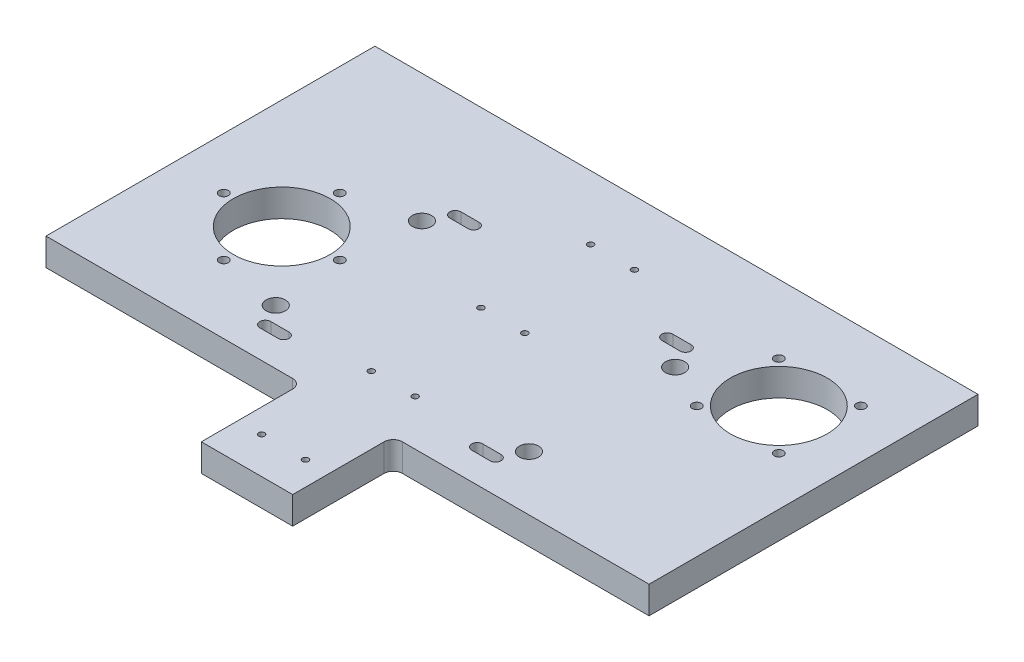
from build123d import *

# Parameters (mm, degrees)
ESQUISSE1_W              = 330
ESQUISSE1_H              = 150
EXTRUSION1_DEPTH         = 15
ESQUISSE2_R              = 26.5
ESQUISSE2_R_2            = 2.5
EXTRUSION2_DEPTH         = 182.865334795
ESQUISSE4_W              = 50
ESQUISSE4_H              = 15
SUPPORT_MORS_FIXE_DEPTH  = 55
ESQUISSE6_W              = 330
ESQUISSE6_H              = 15
EXTRUSION6_DEPTH         = 30
EXTRUSION9_REACH         = 212.594
ESQUISSE13_R             = 5.25
EXTRUSION10_REACH        = 212.594
FIXATION_GLISSI_RE_REACH = 212.594
ESQUISSE15_R             = 1.65
CONG_2_R                 = 5


with BuildPart() as part:
    # Esquisse1 → Extrusion1 (new body)
    with BuildSketch(Plane(origin=(0, 0, 0), x_dir=(1, 0, 0), z_dir=(0, 1, 0))):
        Rectangle(ESQUISSE1_W, ESQUISSE1_H)
    extrude(amount=-EXTRUSION1_DEPTH)

    # Esquisse2 → Extrusion2 (cut, through all)
    with BuildSketch(Plane(origin=(0, 0, 0), x_dir=(-1, 0, 0), z_dir=(0, 1, 0))):
        with Locations(Location((-116, -45, 0), (0, 0, 90))):
            Circle(ESQUISSE2_R)
        with Locations(Location((105, 6, 0), (0, 0, 90))):
            Circle(ESQUISSE2_R)
        with Locations(Location((104.999999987, -25.749982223, 0), (0, 0, 90))):
            Circle(ESQUISSE2_R_2)
        with Locations(Location((-138.450640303, -22.549359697, 0), (0, 0, 90))):
            Circle(ESQUISSE2_R_2)
        with Locations(Location((-93.549359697, -22.549359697, 0), (0, 0, 90))):
            Circle(ESQUISSE2_R_2)
        with Locations(Location((-93.549359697, -67.450640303, 0), (0, 0, 90))):
            Circle(ESQUISSE2_R_2)
        with Locations(Location((-138.450640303, -67.450640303, 0), (0, 0, 90))):
            Circle(ESQUISSE2_R_2)
        with Locations(Location((73.234990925, 5.984976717, 0), (0, 0, 90))):
            Circle(ESQUISSE2_R_2)
        with Locations(Location((104.969949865, 37.749985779, 0), (0, 0, 90))):
            Circle(ESQUISSE2_R_2)
        with Locations(Location((136.734958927, 6.015026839, 0), (0, 0, 90))):
            Circle(ESQUISSE2_R_2)
    extrude(amount=-EXTRUSION2_DEPTH, mode=Mode.SUBTRACT)

    # Esquisse4 → support mors fixe (add)
    with BuildSketch(Plane.XY.offset(75)):
        with Locations((0, -7.5)):
            Rectangle(ESQUISSE4_W, ESQUISSE4_H)
    extrude(amount=SUPPORT_MORS_FIXE_DEPTH)

    # Esquisse6 → Extrusion6 (add)
    with BuildSketch(Plane(origin=(0, 0, -75), x_dir=(-1, 0, 0), z_dir=(0, 0, -1))):
        with Locations((0, -7.5)):
            Rectangle(ESQUISSE6_W, ESQUISSE6_H)
    extrude(amount=EXTRUSION6_DEPTH)

    # Esquisse13 → Extrusion9 (cut, up to next)
    with BuildSketch(Plane(origin=(0, 0, 0), x_dir=(-1, 0, 0), z_dir=(0, 1, 0)), mode=Mode.PRIVATE) as extrusion9_sk1:
        with Locations(Location((69.28, -35, 0), (0, 0, 90))):
            Circle(ESQUISSE13_R)
    extrusion9_tool1 = extrude(extrusion9_sk1.sketch, amount=-EXTRUSION9_REACH, mode=Mode.PRIVATE) & part.part
    # Esquisse13 → Extrusion9 (cut, up to next)
    with BuildSketch(Plane(origin=(0, 0, 0), x_dir=(-1, 0, 0), z_dir=(0, 1, 0)), mode=Mode.PRIVATE) as extrusion9_sk2:
        with Locations(Location((69.28, 45, 0), (0, 0, 90))):
            Circle(ESQUISSE13_R)
    extrusion9_tool2 = extrude(extrusion9_sk2.sketch, amount=-EXTRUSION9_REACH, mode=Mode.PRIVATE) & part.part
    # Esquisse13 → Extrusion9 (cut, up to next)
    with BuildSketch(Plane(origin=(0, 0, 0), x_dir=(-1, 0, 0), z_dir=(0, 1, 0)), mode=Mode.PRIVATE) as extrusion9_sk3:
        with Locations(Location((-69.28, -35, 0), (0, 0, 90))):
            Circle(ESQUISSE13_R)
    extrusion9_tool3 = extrude(extrusion9_sk3.sketch, amount=-EXTRUSION9_REACH, mode=Mode.PRIVATE) & part.part
    # Esquisse13 → Extrusion9 (cut, up to next)
    with BuildSketch(Plane(origin=(0, 0, 0), x_dir=(-1, 0, 0), z_dir=(0, 1, 0)), mode=Mode.PRIVATE) as extrusion9_sk4:
        with Locations(Location((-69.28, 45, 0), (0, 0, 90))):
            Circle(ESQUISSE13_R)
    extrusion9_tool4 = extrude(extrusion9_sk4.sketch, amount=-EXTRUSION9_REACH, mode=Mode.PRIVATE) & part.part
    add(extrusion9_tool1.solids().sort_by_distance((-69.28, 0, -35))[0], mode=Mode.SUBTRACT)
    add(extrusion9_tool2.solids().sort_by_distance((-69.28, 0, 45))[0], mode=Mode.SUBTRACT)
    add(extrusion9_tool3.solids().sort_by_distance((69.28, 0, -35))[0], mode=Mode.SUBTRACT)
    add(extrusion9_tool4.solids().sort_by_distance((69.28, 0, 45))[0], mode=Mode.SUBTRACT)

    # Esquisse14 → Extrusion10 (cut, up to next)
    with BuildSketch(Plane(origin=(0, 0, 0), x_dir=(-1, 0, 0), z_dir=(0, 1, 0)), mode=Mode.PRIVATE) as extrusion10_sk1:
        with BuildLine():
            Line((63, 54), (53, 54))
            ThreePointArc((53, 54), (50, 57), (53, 60))
            Line((53, 60), (63, 60))
            ThreePointArc((63, 60), (66, 57), (63, 54))
        make_face()
    extrusion10_tool1 = extrude(extrusion10_sk1.sketch, amount=-EXTRUSION10_REACH, mode=Mode.PRIVATE) & part.part
    # Esquisse14 → Extrusion10 (cut, up to next)
    with BuildSketch(Plane(origin=(0, 0, 0), x_dir=(-1, 0, 0), z_dir=(0, 1, 0)), mode=Mode.PRIVATE) as extrusion10_sk2:
        with BuildLine():
            Line((-53, 54), (-63, 54))
            ThreePointArc((-63, 54), (-66, 57), (-63, 60))
            Line((-63, 60), (-53, 60))
            ThreePointArc((-53, 60), (-50, 57), (-53, 54))
        make_face()
    extrusion10_tool2 = extrude(extrusion10_sk2.sketch, amount=-EXTRUSION10_REACH, mode=Mode.PRIVATE) & part.part
    # Esquisse14 → Extrusion10 (cut, up to next)
    with BuildSketch(Plane(origin=(0, 0, 0), x_dir=(-1, 0, 0), z_dir=(0, 1, 0)), mode=Mode.PRIVATE) as extrusion10_sk3:
        with BuildLine():
            Line((63, -50), (53, -50))
            ThreePointArc((53, -50), (50, -47), (53, -44))
            Line((53, -44), (63, -44))
            ThreePointArc((63, -44), (66, -47), (63, -50))
        make_face()
    extrusion10_tool3 = extrude(extrusion10_sk3.sketch, amount=-EXTRUSION10_REACH, mode=Mode.PRIVATE) & part.part
    # Esquisse14 → Extrusion10 (cut, up to next)
    with BuildSketch(Plane(origin=(0, 0, 0), x_dir=(-1, 0, 0), z_dir=(0, 1, 0)), mode=Mode.PRIVATE) as extrusion10_sk4:
        with BuildLine():
            Line((-53, -50), (-63, -50))
            ThreePointArc((-63, -50), (-66, -47), (-63, -44))
            Line((-63, -44), (-53, -44))
            ThreePointArc((-53, -44), (-50, -47), (-53, -50))
        make_face()
    extrusion10_tool4 = extrude(extrusion10_sk4.sketch, amount=-EXTRUSION10_REACH, mode=Mode.PRIVATE) & part.part
    add(extrusion10_tool1.solids().sort_by_distance((-58, 0, 57))[0], mode=Mode.SUBTRACT)
    add(extrusion10_tool2.solids().sort_by_distance((58, 0, 57))[0], mode=Mode.SUBTRACT)
    add(extrusion10_tool3.solids().sort_by_distance((-58, 0, -47))[0], mode=Mode.SUBTRACT)
    add(extrusion10_tool4.solids().sort_by_distance((58, 0, -47))[0], mode=Mode.SUBTRACT)

    # Esquisse15 → fixation glissi_re (cut, up to next)
    with BuildSketch(Plane.XZ.offset(15), mode=Mode.PRIVATE) as fixation_glissi_re_sk1:
        with Locations(Location((12, 110, 0), (0, 0, 270))):
            Circle(ESQUISSE15_R)
    fixation_glissi_re_tool1 = extrude(fixation_glissi_re_sk1.sketch, amount=-FIXATION_GLISSI_RE_REACH, mode=Mode.PRIVATE) & part.part
    # Esquisse15 → fixation glissi_re (cut, up to next)
    with BuildSketch(Plane.XZ.offset(15), mode=Mode.PRIVATE) as fixation_glissi_re_sk2:
        with Locations(Location((-12, 110, 0), (0, 0, 270))):
            Circle(ESQUISSE15_R)
    fixation_glissi_re_tool2 = extrude(fixation_glissi_re_sk2.sketch, amount=-FIXATION_GLISSI_RE_REACH, mode=Mode.PRIVATE) & part.part
    # Esquisse15 → fixation glissi_re (cut, up to next)
    with BuildSketch(Plane.XZ.offset(15), mode=Mode.PRIVATE) as fixation_glissi_re_sk3:
        with Locations(Location((-12, 50, 0), (0, 0, 270))):
            Circle(ESQUISSE15_R)
    fixation_glissi_re_tool3 = extrude(fixation_glissi_re_sk3.sketch, amount=-FIXATION_GLISSI_RE_REACH, mode=Mode.PRIVATE) & part.part
    # Esquisse15 → fixation glissi_re (cut, up to next)
    with BuildSketch(Plane.XZ.offset(15), mode=Mode.PRIVATE) as fixation_glissi_re_sk4:
        with Locations(Location((12, 50, 0), (0, 0, 270))):
            Circle(ESQUISSE15_R)
    fixation_glissi_re_tool4 = extrude(fixation_glissi_re_sk4.sketch, amount=-FIXATION_GLISSI_RE_REACH, mode=Mode.PRIVATE) & part.part
    # Esquisse15 → fixation glissi_re (cut, up to next)
    with BuildSketch(Plane.XZ.offset(15), mode=Mode.PRIVATE) as fixation_glissi_re_sk5:
        with Locations(Location((-12, -10, 0), (0, 0, 270))):
            Circle(ESQUISSE15_R)
    fixation_glissi_re_tool5 = extrude(fixation_glissi_re_sk5.sketch, amount=-FIXATION_GLISSI_RE_REACH, mode=Mode.PRIVATE) & part.part
    # Esquisse15 → fixation glissi_re (cut, up to next)
    with BuildSketch(Plane.XZ.offset(15), mode=Mode.PRIVATE) as fixation_glissi_re_sk6:
        with Locations(Location((12, -10, 0), (0, 0, 270))):
            Circle(ESQUISSE15_R)
    fixation_glissi_re_tool6 = extrude(fixation_glissi_re_sk6.sketch, amount=-FIXATION_GLISSI_RE_REACH, mode=Mode.PRIVATE) & part.part
    # Esquisse15 → fixation glissi_re (cut, up to next)
    with BuildSketch(Plane.XZ.offset(15), mode=Mode.PRIVATE) as fixation_glissi_re_sk7:
        with Locations(Location((-12, -70, 0), (0, 0, 270))):
            Circle(ESQUISSE15_R)
    fixation_glissi_re_tool7 = extrude(fixation_glissi_re_sk7.sketch, amount=-FIXATION_GLISSI_RE_REACH, mode=Mode.PRIVATE) & part.part
    # Esquisse15 → fixation glissi_re (cut, up to next)
    with BuildSketch(Plane.XZ.offset(15), mode=Mode.PRIVATE) as fixation_glissi_re_sk8:
        with Locations(Location((12, -70, 0), (0, 0, 270))):
            Circle(ESQUISSE15_R)
    fixation_glissi_re_tool8 = extrude(fixation_glissi_re_sk8.sketch, amount=-FIXATION_GLISSI_RE_REACH, mode=Mode.PRIVATE) & part.part
    add(fixation_glissi_re_tool1.solids().sort_by_distance((12, -15, 110))[0], mode=Mode.SUBTRACT)
    add(fixation_glissi_re_tool2.solids().sort_by_distance((-12, -15, 110))[0], mode=Mode.SUBTRACT)
    add(fixation_glissi_re_tool3.solids().sort_by_distance((-12, -15, 50))[0], mode=Mode.SUBTRACT)
    add(fixation_glissi_re_tool4.solids().sort_by_distance((12, -15, 50))[0], mode=Mode.SUBTRACT)
    add(fixation_glissi_re_tool5.solids().sort_by_distance((-12, -15, -10))[0], mode=Mode.SUBTRACT)
    add(fixation_glissi_re_tool6.solids().sort_by_distance((12, -15, -10))[0], mode=Mode.SUBTRACT)
    add(fixation_glissi_re_tool7.solids().sort_by_distance((-12, -15, -70))[0], mode=Mode.SUBTRACT)
    add(fixation_glissi_re_tool8.solids().sort_by_distance((12, -15, -70))[0], mode=Mode.SUBTRACT)

    # Cong_2
    cong_2_edges = [part.edges().sort_by_distance(p)[0] for p in [
        (25, -7.5, 75),
        (-25, -7.5, 75),
    ]]
    fillet(cong_2_edges, radius=CONG_2_R)


solid = part.part
